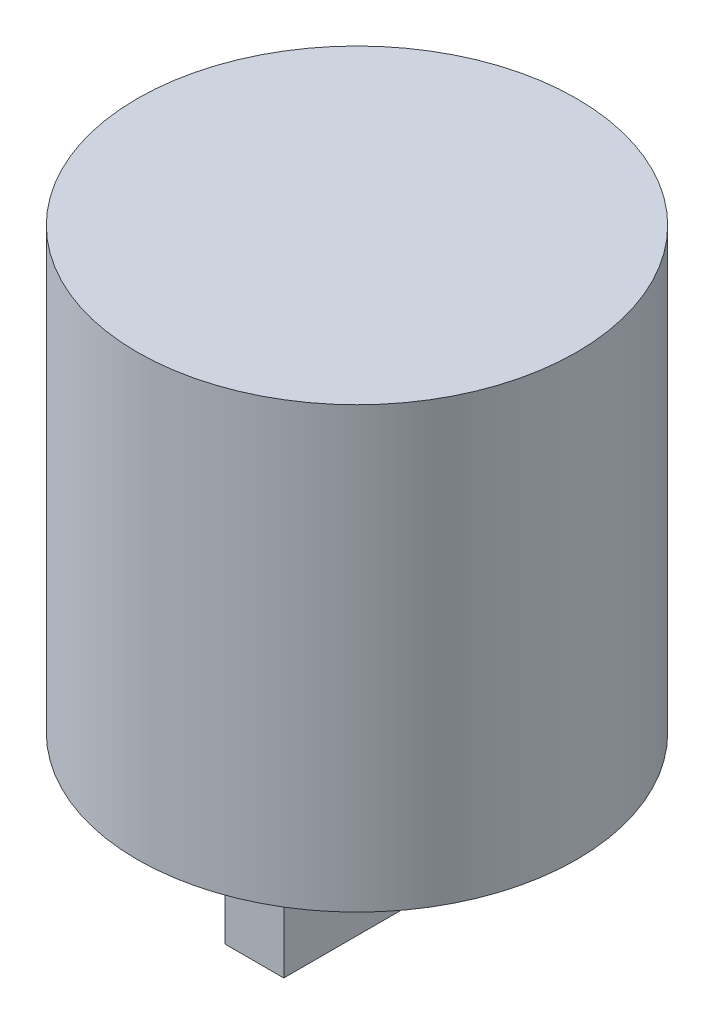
ISO-10303-21;
HEADER;
FILE_DESCRIPTION(('STEP AP214'),'2;1');
FILE_NAME('part.step','',(''),(''),'','','');
FILE_SCHEMA(('AUTOMOTIVE_DESIGN { 1 0 10303 214 1 1 1 1 }'));
ENDSEC;
DATA;
#1=APPLICATION_CONTEXT('core data for automotive mechanical design processes');
#2=APPLICATION_PROTOCOL_DEFINITION('international standard','automotive_design',2000,#1);
#3=PRODUCT_CONTEXT('',#1,'mechanical');
#4=PRODUCT('Part','Part','',(#3));
#5=PRODUCT_RELATED_PRODUCT_CATEGORY('part','',(#4));
#6=PRODUCT_DEFINITION_FORMATION('','',#4);
#7=PRODUCT_DEFINITION_CONTEXT('part definition',#1,'design');
#8=PRODUCT_DEFINITION('design','',#6,#7);
#9=PRODUCT_DEFINITION_SHAPE('','',#8);
#10=(LENGTH_UNIT() NAMED_UNIT(*) SI_UNIT(.MILLI.,.METRE.));
#11=(NAMED_UNIT(*) PLANE_ANGLE_UNIT() SI_UNIT($,.RADIAN.));
#12=(NAMED_UNIT(*) SI_UNIT($,.STERADIAN.) SOLID_ANGLE_UNIT());
#13=UNCERTAINTY_MEASURE_WITH_UNIT(LENGTH_MEASURE(1.E-05),#10,'distance_accuracy_value','');
#14=(GEOMETRIC_REPRESENTATION_CONTEXT(3) GLOBAL_UNCERTAINTY_ASSIGNED_CONTEXT((#13)) GLOBAL_UNIT_ASSIGNED_CONTEXT((#10,
#11,#12)) REPRESENTATION_CONTEXT('',''));
#15=CARTESIAN_POINT('',(0.,0.,0.));
#16=DIRECTION('',(0.,0.,1.));
#17=DIRECTION('',(1.,0.,0.));
#18=AXIS2_PLACEMENT_3D('',#15,#16,#17);
#19=CARTESIAN_POINT('',(0.,0.,0.));
#20=DIRECTION('',(0.,1.,0.));
#21=DIRECTION('',(0.,0.,1.));
#22=AXIS2_PLACEMENT_3D('',#19,#20,#21);
#23=PLANE('',#22);
#24=CARTESIAN_POINT('',(0.,0.,0.));
#25=DIRECTION('',(0.,1.,0.));
#26=DIRECTION('',(0.,0.,1.));
#27=AXIS2_PLACEMENT_3D('',#24,#25,#26);
#28=CIRCLE('',#27,19.05);
#29=CARTESIAN_POINT('',(0.,0.,-19.05));
#30=VERTEX_POINT('',#29);
#31=EDGE_CURVE('E42',#30,#30,#28,.T.);
#32=ORIENTED_EDGE('',*,*,#31,.F.);
#33=EDGE_LOOP('',(#32));
#34=FACE_BOUND('',#33,.T.);
#35=DIRECTION('',(0.,0.,1.));
#36=VECTOR('',#35,1.);
#37=CARTESIAN_POINT('',(-2.54,0.,8.89));
#38=LINE('',#37,#36);
#39=CARTESIAN_POINT('',(-2.54,0.,-8.89));
#40=VERTEX_POINT('',#39);
#41=CARTESIAN_POINT('',(-2.54,0.,8.89));
#42=VERTEX_POINT('',#41);
#43=EDGE_CURVE('E104',#40,#42,#38,.T.);
#44=ORIENTED_EDGE('',*,*,#43,.T.);
#45=DIRECTION('',(1.,0.,0.));
#46=VECTOR('',#45,1.);
#47=CARTESIAN_POINT('',(-2.54,0.,8.89));
#48=LINE('',#47,#46);
#49=CARTESIAN_POINT('',(2.54,0.,8.89));
#50=VERTEX_POINT('',#49);
#51=EDGE_CURVE('E110',#42,#50,#48,.T.);
#52=ORIENTED_EDGE('',*,*,#51,.T.);
#53=DIRECTION('',(0.,0.,1.));
#54=VECTOR('',#53,1.);
#55=CARTESIAN_POINT('',(2.54,0.,8.89));
#56=LINE('',#55,#54);
#57=CARTESIAN_POINT('',(2.54,0.,-8.89));
#58=VERTEX_POINT('',#57);
#59=EDGE_CURVE('E88',#58,#50,#56,.T.);
#60=ORIENTED_EDGE('',*,*,#59,.F.);
#61=DIRECTION('',(1.,0.,0.));
#62=VECTOR('',#61,1.);
#63=CARTESIAN_POINT('',(-2.54,0.,-8.89));
#64=LINE('',#63,#62);
#65=EDGE_CURVE('E82',#40,#58,#64,.T.);
#66=ORIENTED_EDGE('',*,*,#65,.F.);
#67=EDGE_LOOP('',(#44,#52,#60,#66));
#68=FACE_BOUND('',#67,.T.);
#69=ADVANCED_FACE('F33',(#34,#68),#23,.F.);
#70=CARTESIAN_POINT('',(0.,38.1,0.));
#71=DIRECTION('',(0.,-1.,0.));
#72=DIRECTION('',(0.,0.,-1.));
#73=AXIS2_PLACEMENT_3D('',#70,#71,#72);
#74=CYLINDRICAL_SURFACE('',#73,19.05);
#75=CARTESIAN_POINT('',(0.,38.1,0.));
#76=DIRECTION('',(0.,1.,0.));
#77=DIRECTION('',(0.,0.,1.));
#78=AXIS2_PLACEMENT_3D('',#75,#76,#77);
#79=CIRCLE('',#78,19.05);
#80=CARTESIAN_POINT('',(0.,38.1,-19.05));
#81=VERTEX_POINT('',#80);
#82=EDGE_CURVE('E11',#81,#81,#79,.T.);
#83=CARTESIAN_POINT('',(0.,38.1,-19.05));
#84=CARTESIAN_POINT('',(0.,37.703125,-19.05));
#85=CARTESIAN_POINT('',(0.,37.30625,-19.05));
#86=CARTESIAN_POINT('',(0.,36.5125,-19.05));
#87=CARTESIAN_POINT('',(0.,36.115625,-19.05));
#88=CARTESIAN_POINT('',(0.,35.321875,-19.05));
#89=CARTESIAN_POINT('',(0.,34.925,-19.05));
#90=CARTESIAN_POINT('',(0.,34.13125,-19.05));
#91=CARTESIAN_POINT('',(0.,33.734375,-19.05));
#92=CARTESIAN_POINT('',(0.,32.940625,-19.05));
#93=CARTESIAN_POINT('',(0.,32.54375,-19.05));
#94=CARTESIAN_POINT('',(0.,31.75,-19.05));
#95=CARTESIAN_POINT('',(0.,31.353125,-19.05));
#96=CARTESIAN_POINT('',(0.,30.559375,-19.05));
#97=CARTESIAN_POINT('',(0.,30.1625,-19.05));
#98=CARTESIAN_POINT('',(0.,29.36875,-19.05));
#99=CARTESIAN_POINT('',(0.,28.971875,-19.05));
#100=CARTESIAN_POINT('',(0.,28.178125,-19.05));
#101=CARTESIAN_POINT('',(0.,27.78125,-19.05));
#102=CARTESIAN_POINT('',(0.,26.9875,-19.05));
#103=CARTESIAN_POINT('',(0.,26.590625,-19.05));
#104=CARTESIAN_POINT('',(0.,25.796875,-19.05));
#105=CARTESIAN_POINT('',(0.,25.4,-19.05));
#106=CARTESIAN_POINT('',(0.,24.60625,-19.05));
#107=CARTESIAN_POINT('',(0.,24.209375,-19.05));
#108=CARTESIAN_POINT('',(0.,23.415625,-19.05));
#109=CARTESIAN_POINT('',(0.,23.01875,-19.05));
#110=CARTESIAN_POINT('',(0.,22.225,-19.05));
#111=CARTESIAN_POINT('',(0.,21.828125,-19.05));
#112=CARTESIAN_POINT('',(0.,21.034375,-19.05));
#113=CARTESIAN_POINT('',(0.,20.6375,-19.05));
#114=CARTESIAN_POINT('',(0.,19.84375,-19.05));
#115=CARTESIAN_POINT('',(0.,19.446875,-19.05));
#116=CARTESIAN_POINT('',(0.,18.653125,-19.05));
#117=CARTESIAN_POINT('',(0.,18.25625,-19.05));
#118=CARTESIAN_POINT('',(0.,17.4625,-19.05));
#119=CARTESIAN_POINT('',(0.,17.065625,-19.05));
#120=CARTESIAN_POINT('',(0.,16.271875,-19.05));
#121=CARTESIAN_POINT('',(0.,15.875,-19.05));
#122=CARTESIAN_POINT('',(0.,15.08125,-19.05));
#123=CARTESIAN_POINT('',(0.,14.684375,-19.05));
#124=CARTESIAN_POINT('',(0.,13.890625,-19.05));
#125=CARTESIAN_POINT('',(0.,13.49375,-19.05));
#126=CARTESIAN_POINT('',(0.,12.7,-19.05));
#127=CARTESIAN_POINT('',(0.,12.303125,-19.05));
#128=CARTESIAN_POINT('',(0.,11.509375,-19.05));
#129=CARTESIAN_POINT('',(0.,11.1125,-19.05));
#130=CARTESIAN_POINT('',(0.,10.31875,-19.05));
#131=CARTESIAN_POINT('',(0.,9.92187499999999,-19.05));
#132=CARTESIAN_POINT('',(0.,9.128125,-19.05));
#133=CARTESIAN_POINT('',(0.,8.73124999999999,-19.05));
#134=CARTESIAN_POINT('',(0.,7.93749999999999,-19.05));
#135=CARTESIAN_POINT('',(0.,7.54062499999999,-19.05));
#136=CARTESIAN_POINT('',(0.,6.746875,-19.05));
#137=CARTESIAN_POINT('',(0.,6.35,-19.05));
#138=CARTESIAN_POINT('',(0.,5.55625,-19.05));
#139=CARTESIAN_POINT('',(0.,5.159375,-19.05));
#140=CARTESIAN_POINT('',(0.,4.365625,-19.05));
#141=CARTESIAN_POINT('',(0.,3.96875,-19.05));
#142=CARTESIAN_POINT('',(0.,3.175,-19.05));
#143=CARTESIAN_POINT('',(0.,2.778125,-19.05));
#144=CARTESIAN_POINT('',(0.,1.984375,-19.05));
#145=CARTESIAN_POINT('',(0.,1.5875,-19.05));
#146=CARTESIAN_POINT('',(0.,0.79375,-19.05));
#147=CARTESIAN_POINT('',(0.,0.396875,-19.05));
#148=CARTESIAN_POINT('',(0.,0.,-19.05));
#149=B_SPLINE_CURVE_WITH_KNOTS('',3,(#83,#84,#85,#86,#87,#88,#89,#90,#91,#92,#93,#94,#95,#96,
#97,#98,#99,#100,#101,#102,#103,#104,#105,#106,#107,#108,#109,#110,#111,#112,#113,#114,#115,
#116,#117,#118,#119,#120,#121,#122,#123,#124,#125,#126,#127,#128,#129,#130,#131,#132,#133,#134,
#135,#136,#137,#138,#139,#140,#141,#142,#143,#144,#145,#146,#147,#148),.UNSPECIFIED.,.F.,.F.,(4,
2,2,2,2,2,2,2,2,2,2,2,2,2,2,2,2,2,2,2,2,2,2,2,2,2,2,2,2,2,2,2,4),(0.,1.190625,2.38125,3.571875,
4.7625,5.953125,7.14375,8.334375,9.52500000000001,10.715625,11.90625,13.096875,14.2875,
15.478125,16.66875,17.859375,19.05,20.240625,21.43125,22.621875,23.8125,25.003125,26.19375,
27.384375,28.575,29.765625,30.95625,32.146875,33.3375,34.528125,35.71875,36.909375,38.1),.UNSPECIFIED.);
#150=EDGE_CURVE('BSEAM35',#81,#30,#149,.T.);
#151=ORIENTED_EDGE('',*,*,#82,.F.);
#152=ORIENTED_EDGE('',*,*,#31,.T.);
#153=ORIENTED_EDGE('',*,*,#150,.T.);
#154=ORIENTED_EDGE('',*,*,#150,.F.);
#155=EDGE_LOOP('',(#151,#153,#152,#154));
#156=FACE_BOUND('',#155,.T.);
#157=ADVANCED_FACE('F35',(#156),#74,.T.);
#158=CARTESIAN_POINT('',(0.,38.1,0.));
#159=DIRECTION('',(0.,1.,0.));
#160=DIRECTION('',(0.,0.,1.));
#161=AXIS2_PLACEMENT_3D('',#158,#159,#160);
#162=PLANE('',#161);
#163=ORIENTED_EDGE('',*,*,#82,.T.);
#164=EDGE_LOOP('',(#163));
#165=FACE_BOUND('',#164,.T.);
#166=ADVANCED_FACE('F131',(#165),#162,.T.);
#167=CARTESIAN_POINT('',(-2.54,-12.7,8.89));
#168=DIRECTION('',(0.,-1.,0.));
#169=DIRECTION('',(0.,0.,-1.));
#170=AXIS2_PLACEMENT_3D('',#167,#168,#169);
#171=PLANE('',#170);
#172=DIRECTION('',(1.,0.,0.));
#173=VECTOR('',#172,1.);
#174=CARTESIAN_POINT('',(-2.54,-12.7,-8.89));
#175=LINE('',#174,#173);
#176=CARTESIAN_POINT('',(-2.54,-12.7,-8.89));
#177=VERTEX_POINT('',#176);
#178=CARTESIAN_POINT('',(2.54,-12.7,-8.89));
#179=VERTEX_POINT('',#178);
#180=EDGE_CURVE('E75',#177,#179,#175,.T.);
#181=ORIENTED_EDGE('',*,*,#180,.T.);
#182=DIRECTION('',(0.,0.,-1.));
#183=VECTOR('',#182,1.);
#184=CARTESIAN_POINT('',(2.54,-12.7,8.89));
#185=LINE('',#184,#183);
#186=CARTESIAN_POINT('',(2.54,-12.7,8.89));
#187=VERTEX_POINT('',#186);
#188=EDGE_CURVE('E77',#187,#179,#185,.T.);
#189=ORIENTED_EDGE('',*,*,#188,.F.);
#190=DIRECTION('',(1.,0.,0.));
#191=VECTOR('',#190,1.);
#192=CARTESIAN_POINT('',(-2.54,-12.7,8.89));
#193=LINE('',#192,#191);
#194=CARTESIAN_POINT('',(-2.54,-12.7,8.89));
#195=VERTEX_POINT('',#194);
#196=EDGE_CURVE('E58',#195,#187,#193,.T.);
#197=ORIENTED_EDGE('',*,*,#196,.F.);
#198=DIRECTION('',(0.,0.,-1.));
#199=VECTOR('',#198,1.);
#200=CARTESIAN_POINT('',(-2.54,-12.7,8.89));
#201=LINE('',#200,#199);
#202=EDGE_CURVE('E78',#195,#177,#201,.T.);
#203=ORIENTED_EDGE('',*,*,#202,.T.);
#204=EDGE_LOOP('',(#181,#189,#197,#203));
#205=FACE_BOUND('',#204,.T.);
#206=ADVANCED_FACE('F76',(#205),#171,.T.);
#207=CARTESIAN_POINT('',(-2.54,-12.7,8.89));
#208=DIRECTION('',(0.,0.,1.));
#209=DIRECTION('',(1.,0.,0.));
#210=AXIS2_PLACEMENT_3D('',#207,#208,#209);
#211=PLANE('',#210);
#212=ORIENTED_EDGE('',*,*,#196,.T.);
#213=DIRECTION('',(0.,-1.,0.));
#214=VECTOR('',#213,1.);
#215=CARTESIAN_POINT('',(2.54,-12.7,8.89));
#216=LINE('',#215,#214);
#217=EDGE_CURVE('E93',#50,#187,#216,.T.);
#218=ORIENTED_EDGE('',*,*,#217,.F.);
#219=ORIENTED_EDGE('',*,*,#51,.F.);
#220=DIRECTION('',(0.,-1.,0.));
#221=VECTOR('',#220,1.);
#222=CARTESIAN_POINT('',(-2.54,-12.7,8.89));
#223=LINE('',#222,#221);
#224=EDGE_CURVE('E83',#42,#195,#223,.T.);
#225=ORIENTED_EDGE('',*,*,#224,.T.);
#226=EDGE_LOOP('',(#212,#218,#219,#225));
#227=FACE_BOUND('',#226,.T.);
#228=ADVANCED_FACE('F123',(#227),#211,.T.);
#229=CARTESIAN_POINT('',(-2.54,-12.7,-8.89));
#230=DIRECTION('',(0.,0.,-1.));
#231=DIRECTION('',(-1.,0.,0.));
#232=AXIS2_PLACEMENT_3D('',#229,#230,#231);
#233=PLANE('',#232);
#234=ORIENTED_EDGE('',*,*,#65,.T.);
#235=DIRECTION('',(0.,1.,0.));
#236=VECTOR('',#235,1.);
#237=CARTESIAN_POINT('',(2.54,-12.7,-8.89));
#238=LINE('',#237,#236);
#239=EDGE_CURVE('E50',#179,#58,#238,.T.);
#240=ORIENTED_EDGE('',*,*,#239,.F.);
#241=ORIENTED_EDGE('',*,*,#180,.F.);
#242=DIRECTION('',(0.,1.,0.));
#243=VECTOR('',#242,1.);
#244=CARTESIAN_POINT('',(-2.54,-12.7,-8.89));
#245=LINE('',#244,#243);
#246=EDGE_CURVE('E102',#177,#40,#245,.T.);
#247=ORIENTED_EDGE('',*,*,#246,.T.);
#248=EDGE_LOOP('',(#234,#240,#241,#247));
#249=FACE_BOUND('',#248,.T.);
#250=ADVANCED_FACE('F85',(#249),#233,.T.);
#251=CARTESIAN_POINT('',(-2.54,0.,0.));
#252=DIRECTION('',(1.,0.,0.));
#253=DIRECTION('',(0.,0.,-1.));
#254=AXIS2_PLACEMENT_3D('',#251,#252,#253);
#255=PLANE('',#254);
#256=CARTESIAN_POINT('',(-2.54,-7.62,0.));
#257=DIRECTION('',(-1.,0.,0.));
#258=DIRECTION('',(0.,0.,1.));
#259=AXIS2_PLACEMENT_3D('',#256,#257,#258);
#260=CIRCLE('',#259,2.54);
#261=CARTESIAN_POINT('',(-2.54,-7.62,2.54));
#262=VERTEX_POINT('',#261);
#263=EDGE_CURVE('E96',#262,#262,#260,.T.);
#264=ORIENTED_EDGE('',*,*,#263,.F.);
#265=EDGE_LOOP('',(#264));
#266=FACE_BOUND('',#265,.T.);
#267=ORIENTED_EDGE('',*,*,#202,.F.);
#268=ORIENTED_EDGE('',*,*,#224,.F.);
#269=ORIENTED_EDGE('',*,*,#43,.F.);
#270=ORIENTED_EDGE('',*,*,#246,.F.);
#271=EDGE_LOOP('',(#267,#268,#269,#270));
#272=FACE_BOUND('',#271,.T.);
#273=ADVANCED_FACE('F121',(#266,#272),#255,.F.);
#274=CARTESIAN_POINT('',(2.54,0.,0.));
#275=DIRECTION('',(1.,0.,0.));
#276=DIRECTION('',(0.,0.,-1.));
#277=AXIS2_PLACEMENT_3D('',#274,#275,#276);
#278=PLANE('',#277);
#279=CARTESIAN_POINT('',(2.54,-7.62,0.));
#280=DIRECTION('',(1.,0.,0.));
#281=DIRECTION('',(0.,0.,-1.));
#282=AXIS2_PLACEMENT_3D('',#279,#280,#281);
#283=CIRCLE('',#282,2.54);
#284=CARTESIAN_POINT('',(2.54,-7.62,-2.54));
#285=VERTEX_POINT('',#284);
#286=EDGE_CURVE('E37',#285,#285,#283,.T.);
#287=ORIENTED_EDGE('',*,*,#286,.F.);
#288=EDGE_LOOP('',(#287));
#289=FACE_BOUND('',#288,.T.);
#290=ORIENTED_EDGE('',*,*,#188,.T.);
#291=ORIENTED_EDGE('',*,*,#239,.T.);
#292=ORIENTED_EDGE('',*,*,#59,.T.);
#293=ORIENTED_EDGE('',*,*,#217,.T.);
#294=EDGE_LOOP('',(#290,#291,#292,#293));
#295=FACE_BOUND('',#294,.T.);
#296=ADVANCED_FACE('F91',(#289,#295),#278,.T.);
#297=CARTESIAN_POINT('',(19.05,-7.62,0.));
#298=DIRECTION('',(-1.,0.,0.));
#299=DIRECTION('',(0.,0.,1.));
#300=AXIS2_PLACEMENT_3D('',#297,#298,#299);
#301=CYLINDRICAL_SURFACE('',#300,2.54);
#302=ORIENTED_EDGE('',*,*,#286,.T.);
#303=EDGE_LOOP('',(#302));
#304=FACE_BOUND('',#303,.T.);
#305=ORIENTED_EDGE('',*,*,#263,.T.);
#306=EDGE_LOOP('',(#305));
#307=FACE_BOUND('',#306,.T.);
#308=ADVANCED_FACE('F184',(#304,#307),#301,.F.);
#309=CLOSED_SHELL('',(#69,#157,#166,#206,#228,#250,#273,#296,#308));
#310=MANIFOLD_SOLID_BREP('B2',#309);
#311=ADVANCED_BREP_SHAPE_REPRESENTATION('',(#18,#310),#14);
#312=SHAPE_DEFINITION_REPRESENTATION(#9,#311);
ENDSEC;
END-ISO-10303-21;
